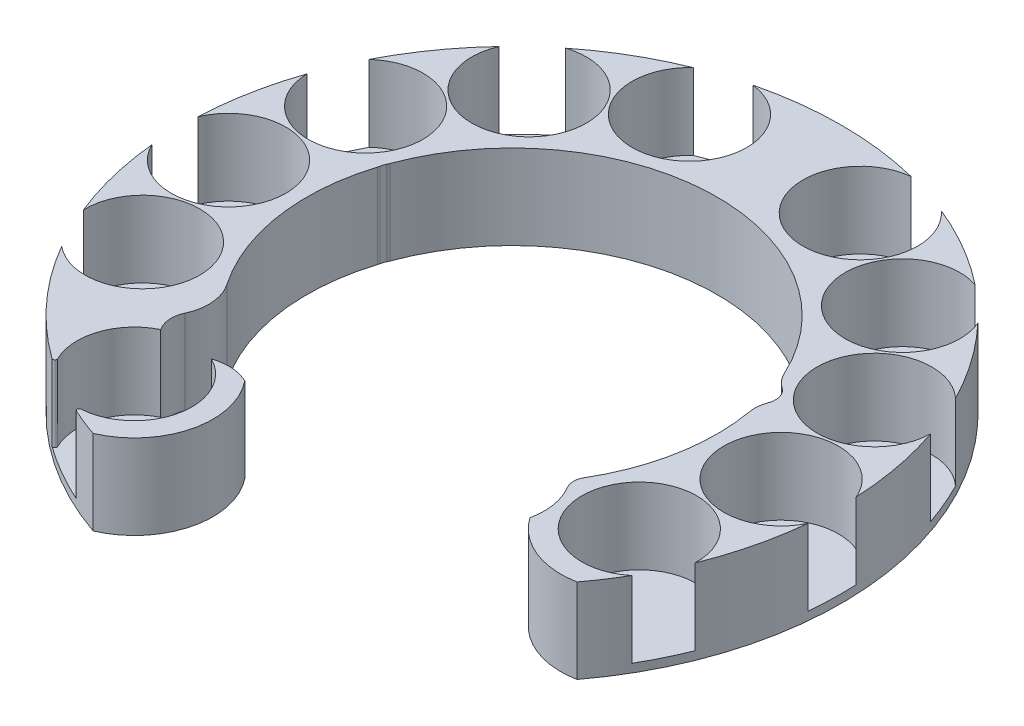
from build123d import *

# Parameters (mm, degrees)
SKETCH1_R           = 99.06
SKETCH1_R_2         = 61.6712
BOSS_EXTRUDE1_DEPTH = 25.4
SKETCH2_R           = 17.25
CUT_EXTRUDE2_DEPTH  = 22.86
FILLET1_R           = 0.635
CUT_EXTRUDE3_DEPTH  = 143.376006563
CUT_EXTRUDE4_DEPTH  = 143.376006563


with BuildPart() as part:
    # Sketch1 → Boss-Extrude1 (new body)
    with BuildSketch(Plane(origin=(0, 0, 0), x_dir=(1, 0, 0), z_dir=(0, 1, 0))):
        with Locations(Location((0, 0, 0), (0, 0, 270))):
            Circle(SKETCH1_R)
        with Locations(Location((0, 0, 0), (0, 0, 270))):
            Circle(SKETCH1_R_2, mode=Mode.SUBTRACT)
    extrude(amount=BOSS_EXTRUDE1_DEPTH)

    # Sketch2 → Cut-Extrude2 (cut)
    with BuildSketch(Plane(origin=(0, 25.4, 0), x_dir=(1, 0, 0), z_dir=(0, 1, 0))):
        with Locations((-41.54, -71.949390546)):
            Circle(SKETCH2_R)
        with Locations((-74.671809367, -36.419874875)):
            Circle(SKETCH2_R)
        with Locations((-83.051530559, -2.174780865)):
            Circle(SKETCH2_R)
        with Locations((-76.475543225, 32.461942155)):
            Circle(SKETCH2_R)
        with Locations((-56.128034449, 61.253001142)):
            Circle(SKETCH2_R)
        with Locations((-25.673131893, 79.013775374)):
            Circle(SKETCH2_R)
        with Locations((25.673131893, 79.013775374)):
            Circle(SKETCH2_R)
        with Locations((56.128034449, 61.253001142)):
            Circle(SKETCH2_R)
        with Locations((76.475543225, 32.461942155)):
            Circle(SKETCH2_R)
        with Locations((83.051530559, -2.174780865)):
            Circle(SKETCH2_R)
        with Locations((74.671809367, -36.419874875)):
            Circle(SKETCH2_R)
    extrude(amount=-CUT_EXTRUDE2_DEPTH, mode=Mode.SUBTRACT)

    # Fillet1
    fillet1_edges = [part.edges().sort_by_distance(p)[0] for p in [
        (-43.263691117, 13.97, 89.113055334),
        (-55.542324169, 13.97, 82.023983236),
    ]]
    fillet(fillet1_edges, radius=FILLET1_R)

    # Sketch3 → Cut-Extrude3 (cut, through all)
    with BuildSketch(Plane.XZ):
        with BuildLine():
            ThreePointArc((-37.620534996, 58.464778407), (-47.53900472, 58.213930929), (-49.766977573, 48.545678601))
            ThreePointArc((-49.766977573, 48.545678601), (-48.525977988, 41.521619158), (-50.914268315, 34.800491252))
            ThreePointArc((-50.914268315, 34.800491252), (-39.007998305, 47.767279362), (-23.923346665, 56.841977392))
            ThreePointArc((-23.923346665, 56.841977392), (-30.986183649, 55.845069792), (-37.620534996, 58.464778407))
        make_face()
        with BuildLine():
            ThreePointArc((24.278775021, 59.718771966), (48.775910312, 60.643553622), (53.124771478, 36.517794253))
            ThreePointArc((53.124771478, 36.517794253), (52.410404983, 33.929568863), (53.115175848, 31.338714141))
            ThreePointArc((53.115175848, 31.338714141), (38.651706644, 48.056034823), (19.222184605, 58.59901474))
            ThreePointArc((19.222184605, 58.59901474), (21.903894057, 58.466106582), (24.278775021, 59.718771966))
        make_face()
        with BuildLine():
            ThreePointArc((-58.698268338, -19.081228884), (-58.499384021, -19.868691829), (-58.177544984, -20.614394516))
            ThreePointArc((-58.177544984, -20.614394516), (-58.026458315, -20.924378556), (-57.896750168, -21.243898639))
            ThreePointArc((-57.896750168, -21.243898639), (-58.395027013, -19.833248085), (-58.858939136, -18.410925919))
            ThreePointArc((-58.858939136, -18.410925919), (-58.767221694, -18.74334914), (-58.698268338, -19.081228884))
        make_face()
        with BuildLine():
            ThreePointArc((61.244747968, -15.855457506), (61.332621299, -19.139193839), (59.39278642, -21.790172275))
            ThreePointArc((59.39278642, -21.790172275), (57.420221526, -23.59824901), (55.988116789, -25.858609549))
            ThreePointArc((55.988116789, -25.858609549), (58.871367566, -18.371145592), (60.758162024, -10.572731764))
            ThreePointArc((60.758162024, -10.572731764), (60.650570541, -13.246414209), (61.244747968, -15.855457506))
        make_face()
    extrude(amount=-CUT_EXTRUDE3_DEPTH, mode=Mode.SUBTRACT)

    # Sketch4 → Cut-Extrude4 (cut, through all)
    with BuildSketch(Plane(origin=(0, 25.4, 0), x_dir=(1, 0, 0), z_dir=(0, 1, 0))):
        with BuildLine():
            ThreePointArc((-32.275055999, -93.654708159), (-18.64541522, -77.676343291), (-23.146761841, -57.162613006))
            ThreePointArc((-23.146761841, -57.162613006), (18.030913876, -58.976461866), (51.154462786, -34.446448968))
            ThreePointArc((51.154462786, -34.446448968), (58.893809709, -53.970223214), (79.128282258, -59.595289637))
            ThreePointArc((79.128282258, -59.595289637), (28.96234107, -94.731549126), (-32.275055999, -93.654708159))
        make_face()
    extrude(amount=-CUT_EXTRUDE4_DEPTH, mode=Mode.SUBTRACT)


solid = part.part
